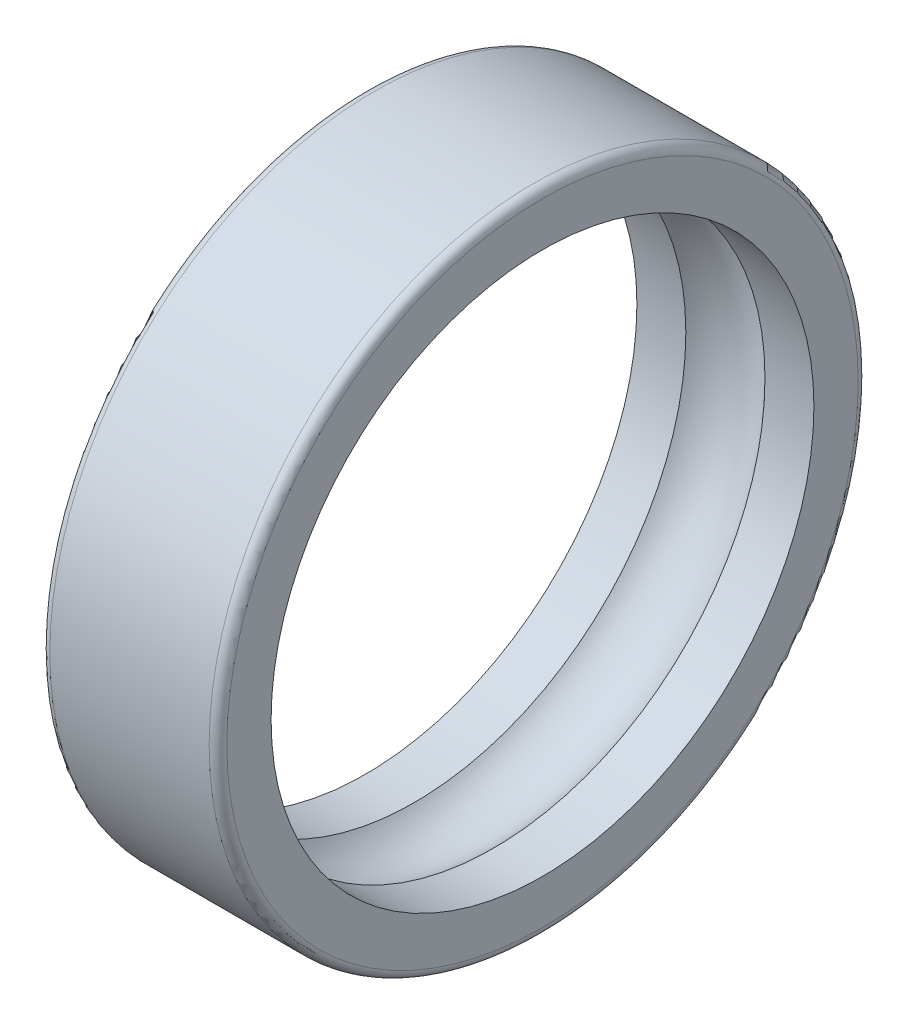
ISO-10303-21;
HEADER;
FILE_DESCRIPTION(('STEP AP214'),'2;1');
FILE_NAME('part.step','',(''),(''),'','','');
FILE_SCHEMA(('AUTOMOTIVE_DESIGN { 1 0 10303 214 1 1 1 1 }'));
ENDSEC;
DATA;
#1=APPLICATION_CONTEXT('core data for automotive mechanical design processes');
#2=APPLICATION_PROTOCOL_DEFINITION('international standard','automotive_design',2000,#1);
#3=PRODUCT_CONTEXT('',#1,'mechanical');
#4=PRODUCT('Part','Part','',(#3));
#5=PRODUCT_RELATED_PRODUCT_CATEGORY('part','',(#4));
#6=PRODUCT_DEFINITION_FORMATION('','',#4);
#7=PRODUCT_DEFINITION_CONTEXT('part definition',#1,'design');
#8=PRODUCT_DEFINITION('design','',#6,#7);
#9=PRODUCT_DEFINITION_SHAPE('','',#8);
#10=(LENGTH_UNIT() NAMED_UNIT(*) SI_UNIT(.MILLI.,.METRE.));
#11=(NAMED_UNIT(*) PLANE_ANGLE_UNIT() SI_UNIT($,.RADIAN.));
#12=(NAMED_UNIT(*) SI_UNIT($,.STERADIAN.) SOLID_ANGLE_UNIT());
#13=UNCERTAINTY_MEASURE_WITH_UNIT(LENGTH_MEASURE(1.E-05),#10,'distance_accuracy_value','');
#14=(GEOMETRIC_REPRESENTATION_CONTEXT(3) GLOBAL_UNCERTAINTY_ASSIGNED_CONTEXT((#13)) GLOBAL_UNIT_ASSIGNED_CONTEXT((#10,
#11,#12)) REPRESENTATION_CONTEXT('',''));
#15=CARTESIAN_POINT('',(0.,0.,0.));
#16=DIRECTION('',(0.,0.,1.));
#17=DIRECTION('',(1.,0.,0.));
#18=AXIS2_PLACEMENT_3D('',#15,#16,#17);
#19=CARTESIAN_POINT('',(0.300000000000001,0.,0.));
#20=DIRECTION('',(-1.,0.,0.));
#21=DIRECTION('',(0.,0.,1.));
#22=AXIS2_PLACEMENT_3D('',#19,#20,#21);
#23=TOROIDAL_SURFACE('',#22,10.7,0.3);
#24=CARTESIAN_POINT('',(0.,0.,0.));
#25=DIRECTION('',(-1.,0.,0.));
#26=DIRECTION('',(0.,0.,1.));
#27=AXIS2_PLACEMENT_3D('',#24,#25,#26);
#28=CIRCLE('',#27,10.7);
#29=CARTESIAN_POINT('',(0.,0.,10.7));
#30=VERTEX_POINT('',#29);
#31=EDGE_CURVE('E10',#30,#30,#28,.T.);
#32=ORIENTED_EDGE('',*,*,#31,.F.);
#33=EDGE_LOOP('',(#32));
#34=FACE_BOUND('',#33,.T.);
#35=CARTESIAN_POINT('',(0.300000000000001,0.,0.));
#36=DIRECTION('',(-1.,0.,0.));
#37=DIRECTION('',(0.,0.,1.));
#38=AXIS2_PLACEMENT_3D('',#35,#36,#37);
#39=CIRCLE('',#38,11.);
#40=CARTESIAN_POINT('',(0.300000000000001,0.,11.));
#41=VERTEX_POINT('',#40);
#42=EDGE_CURVE('E376',#41,#41,#39,.T.);
#43=ORIENTED_EDGE('',*,*,#42,.T.);
#44=EDGE_LOOP('',(#43));
#45=FACE_BOUND('',#44,.T.);
#46=ADVANCED_FACE('F348',(#34,#45),#23,.T.);
#47=CARTESIAN_POINT('',(0.,0.,-10.7));
#48=DIRECTION('',(1.,0.,0.));
#49=DIRECTION('',(0.,0.,-1.));
#50=AXIS2_PLACEMENT_3D('',#47,#48,#49);
#51=PLANE('',#50);
#52=CARTESIAN_POINT('',(0.,0.,0.));
#53=DIRECTION('',(-1.,0.,0.));
#54=DIRECTION('',(0.,0.,1.));
#55=AXIS2_PLACEMENT_3D('',#52,#53,#54);
#56=CIRCLE('',#55,9.2);
#57=CARTESIAN_POINT('',(0.,0.,9.2));
#58=VERTEX_POINT('',#57);
#59=EDGE_CURVE('E354',#58,#58,#56,.T.);
#60=ORIENTED_EDGE('',*,*,#59,.F.);
#61=EDGE_LOOP('',(#60));
#62=FACE_BOUND('',#61,.T.);
#63=ORIENTED_EDGE('',*,*,#31,.T.);
#64=EDGE_LOOP('',(#63));
#65=FACE_BOUND('',#64,.T.);
#66=ADVANCED_FACE('F413',(#62,#65),#51,.F.);
#67=CARTESIAN_POINT('',(0.,0.,0.));
#68=DIRECTION('',(-1.,0.,0.));
#69=DIRECTION('',(0.,0.,1.));
#70=AXIS2_PLACEMENT_3D('',#67,#68,#69);
#71=CYLINDRICAL_SURFACE('',#70,9.2);
#72=CARTESIAN_POINT('',(1.65835921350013,0.,0.));
#73=DIRECTION('',(-1.,0.,0.));
#74=DIRECTION('',(0.,0.,1.));
#75=AXIS2_PLACEMENT_3D('',#72,#73,#74);
#76=CIRCLE('',#75,9.2);
#77=CARTESIAN_POINT('',(1.65835921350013,0.,9.2));
#78=VERTEX_POINT('',#77);
#79=EDGE_CURVE('E358',#78,#78,#76,.T.);
#80=ORIENTED_EDGE('',*,*,#79,.F.);
#81=EDGE_LOOP('',(#80));
#82=FACE_BOUND('',#81,.T.);
#83=ORIENTED_EDGE('',*,*,#59,.T.);
#84=EDGE_LOOP('',(#83));
#85=FACE_BOUND('',#84,.T.);
#86=ADVANCED_FACE('F408',(#82,#85),#71,.F.);
#87=CARTESIAN_POINT('',(3.,0.,0.));
#88=DIRECTION('',(-1.,0.,0.));
#89=DIRECTION('',(0.,0.,1.));
#90=AXIS2_PLACEMENT_3D('',#87,#88,#89);
#91=TOROIDAL_SURFACE('',#90,8.,1.8);
#92=CARTESIAN_POINT('',(4.34164078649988,0.,0.));
#93=DIRECTION('',(-1.,0.,0.));
#94=DIRECTION('',(0.,0.,1.));
#95=AXIS2_PLACEMENT_3D('',#92,#93,#94);
#96=CIRCLE('',#95,9.2);
#97=CARTESIAN_POINT('',(4.34164078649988,0.,9.2));
#98=VERTEX_POINT('',#97);
#99=EDGE_CURVE('E362',#98,#98,#96,.T.);
#100=ORIENTED_EDGE('',*,*,#99,.F.);
#101=EDGE_LOOP('',(#100));
#102=FACE_BOUND('',#101,.T.);
#103=ORIENTED_EDGE('',*,*,#79,.T.);
#104=EDGE_LOOP('',(#103));
#105=FACE_BOUND('',#104,.T.);
#106=ADVANCED_FACE('F402',(#102,#105),#91,.F.);
#107=CARTESIAN_POINT('',(0.,0.,0.));
#108=DIRECTION('',(-1.,0.,0.));
#109=DIRECTION('',(0.,0.,1.));
#110=AXIS2_PLACEMENT_3D('',#107,#108,#109);
#111=CYLINDRICAL_SURFACE('',#110,9.2);
#112=CARTESIAN_POINT('',(6.,0.,0.));
#113=DIRECTION('',(-1.,0.,0.));
#114=DIRECTION('',(0.,0.,1.));
#115=AXIS2_PLACEMENT_3D('',#112,#113,#114);
#116=CIRCLE('',#115,9.2);
#117=CARTESIAN_POINT('',(6.,0.,9.2));
#118=VERTEX_POINT('',#117);
#119=EDGE_CURVE('E367',#118,#118,#116,.T.);
#120=ORIENTED_EDGE('',*,*,#119,.F.);
#121=EDGE_LOOP('',(#120));
#122=FACE_BOUND('',#121,.T.);
#123=ORIENTED_EDGE('',*,*,#99,.T.);
#124=EDGE_LOOP('',(#123));
#125=FACE_BOUND('',#124,.T.);
#126=ADVANCED_FACE('F396',(#122,#125),#111,.F.);
#127=CARTESIAN_POINT('',(6.,0.,-10.7));
#128=DIRECTION('',(-1.,0.,0.));
#129=DIRECTION('',(0.,0.,1.));
#130=AXIS2_PLACEMENT_3D('',#127,#128,#129);
#131=PLANE('',#130);
#132=CARTESIAN_POINT('',(6.,0.,0.));
#133=DIRECTION('',(-1.,0.,0.));
#134=DIRECTION('',(0.,0.,1.));
#135=AXIS2_PLACEMENT_3D('',#132,#133,#134);
#136=CIRCLE('',#135,10.7);
#137=CARTESIAN_POINT('',(6.,0.,10.7));
#138=VERTEX_POINT('',#137);
#139=EDGE_CURVE('E370',#138,#138,#136,.T.);
#140=ORIENTED_EDGE('',*,*,#139,.F.);
#141=EDGE_LOOP('',(#140));
#142=FACE_BOUND('',#141,.T.);
#143=ORIENTED_EDGE('',*,*,#119,.T.);
#144=EDGE_LOOP('',(#143));
#145=FACE_BOUND('',#144,.T.);
#146=ADVANCED_FACE('F390',(#142,#145),#131,.F.);
#147=CARTESIAN_POINT('',(5.7,0.,0.));
#148=DIRECTION('',(-1.,0.,0.));
#149=DIRECTION('',(0.,0.,1.));
#150=AXIS2_PLACEMENT_3D('',#147,#148,#149);
#151=TOROIDAL_SURFACE('',#150,10.7,0.3);
#152=CARTESIAN_POINT('',(5.7,0.,0.));
#153=DIRECTION('',(-1.,0.,0.));
#154=DIRECTION('',(0.,0.,1.));
#155=AXIS2_PLACEMENT_3D('',#152,#153,#154);
#156=CIRCLE('',#155,11.);
#157=CARTESIAN_POINT('',(5.7,0.,11.));
#158=VERTEX_POINT('',#157);
#159=EDGE_CURVE('E373',#158,#158,#156,.T.);
#160=ORIENTED_EDGE('',*,*,#159,.F.);
#161=EDGE_LOOP('',(#160));
#162=FACE_BOUND('',#161,.T.);
#163=ORIENTED_EDGE('',*,*,#139,.T.);
#164=EDGE_LOOP('',(#163));
#165=FACE_BOUND('',#164,.T.);
#166=ADVANCED_FACE('F384',(#162,#165),#151,.T.);
#167=CARTESIAN_POINT('',(0.,0.,0.));
#168=DIRECTION('',(-1.,0.,0.));
#169=DIRECTION('',(0.,0.,1.));
#170=AXIS2_PLACEMENT_3D('',#167,#168,#169);
#171=CYLINDRICAL_SURFACE('',#170,11.);
#172=ORIENTED_EDGE('',*,*,#42,.F.);
#173=EDGE_LOOP('',(#172));
#174=FACE_BOUND('',#173,.T.);
#175=ORIENTED_EDGE('',*,*,#159,.T.);
#176=EDGE_LOOP('',(#175));
#177=FACE_BOUND('',#176,.T.);
#178=ADVANCED_FACE('F381',(#174,#177),#171,.T.);
#179=CLOSED_SHELL('',(#46,#66,#86,#106,#126,#146,#166,#178));
#180=MANIFOLD_SOLID_BREP('B2',#179);
#181=ADVANCED_BREP_SHAPE_REPRESENTATION('',(#18,#180),#14);
#182=SHAPE_DEFINITION_REPRESENTATION(#9,#181);
ENDSEC;
END-ISO-10303-21;
